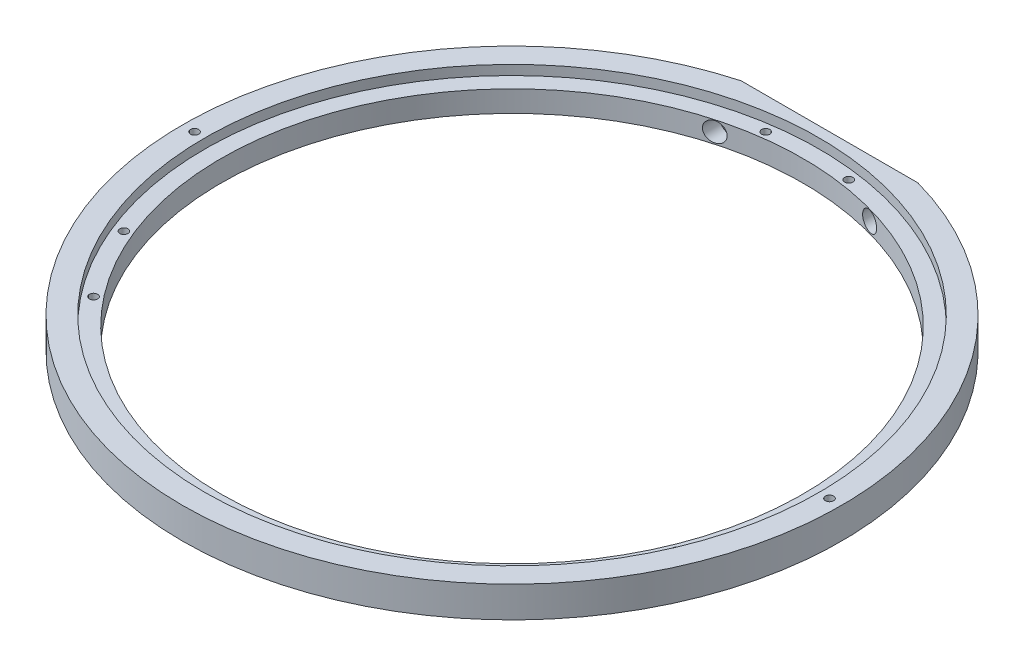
from build123d import *

# Parameters (mm, degrees)
SKETCH1_R                   = 270.256
SKETCH1_R_2                 = 238.506
EXTRUDE1_DEPTH              = 25.4
SKETCH2_R                   = 3.3782
CUT_EXTRUDE1_DEPTH          = 384.042779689
CIRPATTERN1_COUNT           = 3
CIRPATTERN1_COPY_1_SKETCH_R = 3.3782
CIRPATTERN1_COPY_1_DEPTH    = 384.042779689
CIRPATTERN1_COPY_2_SKETCH_R = 3.3782
CIRPATTERN1_COPY_2_DEPTH    = 384.042779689
SKETCH3_R                   = 251.841
CUT_EXTRUDE2_DEPTH          = 7.9248
SKETCH4_R                   = 3.3782
CUT_EXTRUDE3_DEPTH          = 384.042779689
SKETCH5_W                   = 208.146574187
SKETCH5_H                   = 37.127253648
CUT_EXTRUDE4_DEPTH          = 384.042779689
SKETCH6_R                   = 3.3782
CUT_EXTRUDE5_DEPTH          = 35.56
SKETCH7_R                   = 7.9375
CUT_EXTRUDE6_DEPTH          = 28.575


with BuildPart() as part:
    # Sketch1 → Extrude1 (new body)
    with BuildSketch(Plane(origin=(0, 0, 0), x_dir=(1, 0, 0), z_dir=(0, 1, 0))):
        with Locations(Location((0, 0, 0), (0, 0, 270))):
            Circle(SKETCH1_R)
        with Locations(Location((0, 0, 0), (0, 0, 270))):
            Circle(SKETCH1_R_2, mode=Mode.SUBTRACT)
    extrude(amount=-EXTRUDE1_DEPTH)

    # Sketch2 → Cut-Extrude1 (cut, through all)
    with BuildSketch(Plane(origin=(0, 0, 0), x_dir=(-1, 0, 0), z_dir=(0, 1, 0))):
        with Locations(Location((34.024343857, -242.095786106, 0), (0, 0, 90))):
            Circle(SKETCH2_R)
    cut_extrude1 = extrude(amount=-CUT_EXTRUDE1_DEPTH, mode=Mode.SUBTRACT)

    # Mirror1: Cut-Extrude1 across plane
    add(cut_extrude1.mirror(Plane(origin=(0, 0, 0), x_dir=(0, 0, 1), z_dir=(1, 0, 0))), mode=Mode.SUBTRACT)

    # CirPattern1: Cut-Extrude1 ×3 about axis
    cirpattern1_axis = Axis((0, 0, 0), (0, 1, 0))
    for i in range(1, CIRPATTERN1_COUNT):
        add(cut_extrude1.rotate(cirpattern1_axis, i * 360 / CIRPATTERN1_COUNT), mode=Mode.SUBTRACT)

    # CirPattern1 copy 1 sketch → CirPattern1 copy 1 (cut, through all)
    with BuildSketch(Plane(origin=(0, 0, 0), x_dir=(-0.4999999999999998, 0, -0.8660254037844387), z_dir=(0, 1, 0))):
        with Locations((34.024343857, 242.095786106)):
            Circle(CIRPATTERN1_COPY_1_SKETCH_R)
    extrude(amount=-CIRPATTERN1_COPY_1_DEPTH, mode=Mode.SUBTRACT)

    # CirPattern1 copy 2 sketch → CirPattern1 copy 2 (cut, through all)
    with BuildSketch(Plane(origin=(0, 0, 0), x_dir=(-0.5000000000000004, 0, 0.8660254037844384), z_dir=(0, 1, 0))):
        with Locations((34.024343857, 242.095786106)):
            Circle(CIRPATTERN1_COPY_2_SKETCH_R)
    extrude(amount=-CIRPATTERN1_COPY_2_DEPTH, mode=Mode.SUBTRACT)

    # Sketch3 → Cut-Extrude2 (cut)
    with BuildSketch(Plane(origin=(0, 0, 0), x_dir=(-1, 0, 0), z_dir=(0, 1, 0))):
        with Locations(Location((0, 0, 0), (0, 0, 90))):
            Circle(SKETCH3_R)
    extrude(amount=-CUT_EXTRUDE2_DEPTH, mode=Mode.SUBTRACT)

    # Sketch4 → Cut-Extrude3 (cut, through all)
    with BuildSketch(Plane(origin=(0, 0, 0), x_dir=(-1, 0, 0), z_dir=(0, 1, 0))):
        with Locations(Location((260.35, 0, 0), (0, 0, 90))):
            Circle(SKETCH4_R)
    cut_extrude3 = extrude(amount=-CUT_EXTRUDE3_DEPTH, mode=Mode.SUBTRACT)

    # Mirror2: Cut-Extrude3 across plane
    add(cut_extrude3.mirror(Plane(origin=(0, 0, 0), x_dir=(0, 0, 1), z_dir=(1, 0, 0))), mode=Mode.SUBTRACT)

    # Sketch5 → Cut-Extrude4 (cut, through all)
    with BuildSketch(Plane(origin=(0, 0, 0), x_dir=(1, 0, 0), z_dir=(0, 1, 0))):
        with Locations((-3.464967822, 278.913626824)):
            Rectangle(SKETCH5_W, SKETCH5_H)
    extrude(amount=-CUT_EXTRUDE4_DEPTH, mode=Mode.SUBTRACT)

    # Sketch6 → Cut-Extrude5 (cut)
    with BuildSketch(Plane(origin=(0, 0, -260.35), x_dir=(-1, 0, 0), z_dir=(0, 0, -1))):
        with Locations((63.5, -16.51)):
            Circle(SKETCH6_R)
    cut_extrude5 = extrude(amount=-CUT_EXTRUDE5_DEPTH, mode=Mode.SUBTRACT)

    # Sketch7 → Cut-Extrude6 (cut)
    with BuildSketch(Plane.XY.offset(-213.36)):
        with Locations((-63.5, -16.51)):
            Circle(SKETCH7_R)
    cut_extrude6 = extrude(amount=-CUT_EXTRUDE6_DEPTH, mode=Mode.SUBTRACT)

    # Mirror3: Cut-Extrude5, Cut-Extrude6 across plane
    add(cut_extrude5.mirror(Plane(origin=(0, 0, 0), x_dir=(0, 0, 1), z_dir=(1, 0, 0))), mode=Mode.SUBTRACT)
    add(cut_extrude6.mirror(Plane(origin=(0, 0, 0), x_dir=(0, 0, 1), z_dir=(1, 0, 0))), mode=Mode.SUBTRACT)


solid = part.part
